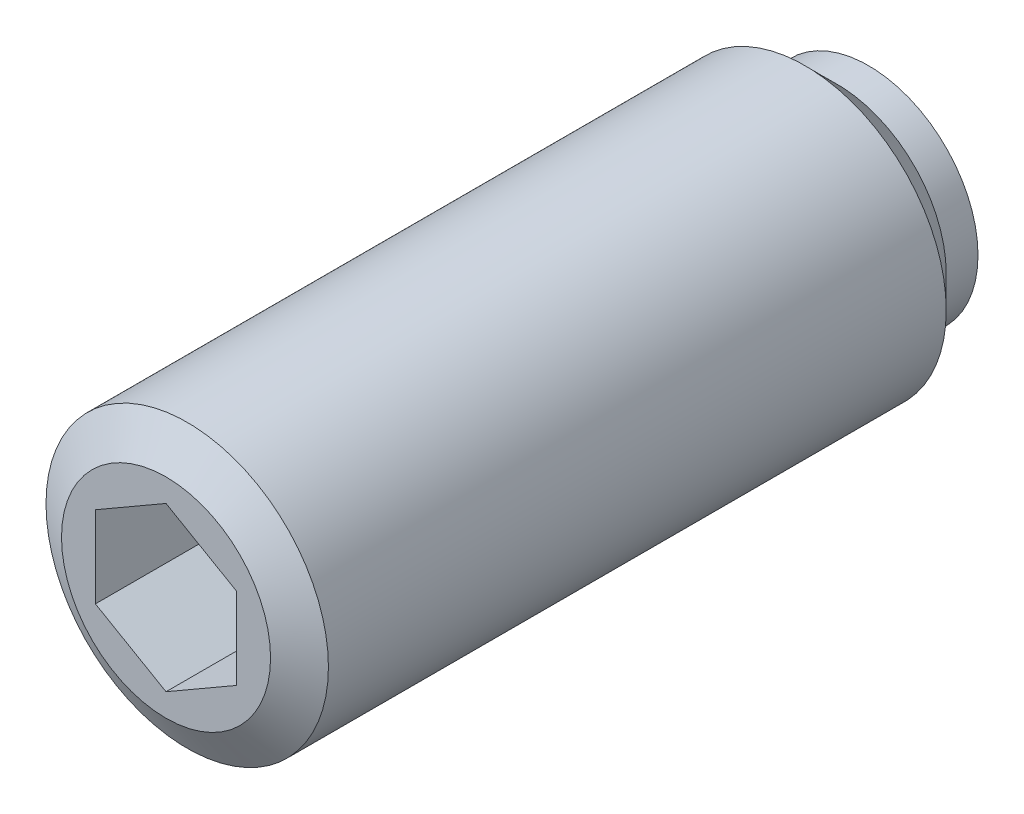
ISO-10303-21;
HEADER;
FILE_DESCRIPTION(('STEP AP214'),'2;1');
FILE_NAME('part.step','',(''),(''),'','','');
FILE_SCHEMA(('AUTOMOTIVE_DESIGN { 1 0 10303 214 1 1 1 1 }'));
ENDSEC;
DATA;
#1=APPLICATION_CONTEXT('core data for automotive mechanical design processes');
#2=APPLICATION_PROTOCOL_DEFINITION('international standard','automotive_design',2000,#1);
#3=PRODUCT_CONTEXT('',#1,'mechanical');
#4=PRODUCT('Part','Part','',(#3));
#5=PRODUCT_RELATED_PRODUCT_CATEGORY('part','',(#4));
#6=PRODUCT_DEFINITION_FORMATION('','',#4);
#7=PRODUCT_DEFINITION_CONTEXT('part definition',#1,'design');
#8=PRODUCT_DEFINITION('design','',#6,#7);
#9=PRODUCT_DEFINITION_SHAPE('','',#8);
#10=(LENGTH_UNIT() NAMED_UNIT(*) SI_UNIT(.MILLI.,.METRE.));
#11=(NAMED_UNIT(*) PLANE_ANGLE_UNIT() SI_UNIT($,.RADIAN.));
#12=(NAMED_UNIT(*) SI_UNIT($,.STERADIAN.) SOLID_ANGLE_UNIT());
#13=UNCERTAINTY_MEASURE_WITH_UNIT(LENGTH_MEASURE(1.E-05),#10,'distance_accuracy_value','');
#14=(GEOMETRIC_REPRESENTATION_CONTEXT(3) GLOBAL_UNCERTAINTY_ASSIGNED_CONTEXT((#13)) GLOBAL_UNIT_ASSIGNED_CONTEXT((#10,
#11,#12)) REPRESENTATION_CONTEXT('',''));
#15=CARTESIAN_POINT('',(0.,0.,0.));
#16=DIRECTION('',(0.,0.,1.));
#17=DIRECTION('',(1.,0.,0.));
#18=AXIS2_PLACEMENT_3D('',#15,#16,#17);
#19=CARTESIAN_POINT('',(0.,2.09621086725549,0.));
#20=DIRECTION('',(0.,0.,1.));
#21=DIRECTION('',(-1.,0.,0.));
#22=AXIS2_PLACEMENT_3D('',#19,#20,#21);
#23=PLANE('',#22);
#24=CARTESIAN_POINT('',(0.,0.,0.));
#25=DIRECTION('',(0.,0.,1.));
#26=DIRECTION('',(-1.,0.,0.));
#27=AXIS2_PLACEMENT_3D('',#24,#25,#26);
#28=CIRCLE('',#27,2.09621086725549);
#29=CARTESIAN_POINT('',(0.,2.09621086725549,0.));
#30=VERTEX_POINT('',#29);
#31=EDGE_CURVE('E9',#30,#30,#28,.T.);
#32=ORIENTED_EDGE('',*,*,#31,.F.);
#33=EDGE_LOOP('',(#32));
#34=FACE_BOUND('',#33,.T.);
#35=ADVANCED_FACE('F14',(#34),#23,.F.);
#36=CARTESIAN_POINT('',(0.,0.,1.78));
#37=DIRECTION('',(0.,0.,1.));
#38=DIRECTION('',(0.,1.,0.));
#39=AXIS2_PLACEMENT_3D('',#36,#37,#38);
#40=SPHERICAL_SURFACE('',#39,2.75);
#41=CARTESIAN_POINT('',(0.,0.,0.5));
#42=DIRECTION('',(0.,0.,1.));
#43=DIRECTION('',(-1.,0.,0.));
#44=AXIS2_PLACEMENT_3D('',#41,#42,#43);
#45=CIRCLE('',#44,2.43394741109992);
#46=CARTESIAN_POINT('',(0.,2.43394741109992,0.5));
#47=VERTEX_POINT('',#46);
#48=EDGE_CURVE('E21',#47,#47,#45,.T.);
#49=CARTESIAN_POINT('',(0.,2.43394741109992,0.5));
#50=CARTESIAN_POINT('',(0.,2.43101603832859,0.494425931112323));
#51=CARTESIAN_POINT('',(0.,2.42806551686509,0.488861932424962));
#52=CARTESIAN_POINT('',(0.,2.42212631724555,0.477754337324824));
#53=CARTESIAN_POINT('',(0.,2.41913763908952,0.472210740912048));
#54=CARTESIAN_POINT('',(0.,2.41312226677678,0.46114421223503));
#55=CARTESIAN_POINT('',(0.,2.41009557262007,0.455621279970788));
#56=CARTESIAN_POINT('',(0.,2.40400431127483,0.444596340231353));
#57=CARTESIAN_POINT('',(0.,2.40093974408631,0.439094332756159));
#58=CARTESIAN_POINT('',(0.,2.39477288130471,0.428111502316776));
#59=CARTESIAN_POINT('',(0.,2.39167058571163,0.422630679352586));
#60=CARTESIAN_POINT('',(0.,2.38542841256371,0.411690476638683));
#61=CARTESIAN_POINT('',(0.,2.38228853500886,0.40623109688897));
#62=CARTESIAN_POINT('',(0.,2.37597134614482,0.39533403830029));
#63=CARTESIAN_POINT('',(0.,2.37279403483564,0.389896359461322));
#64=CARTESIAN_POINT('',(0.,2.36640212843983,0.379042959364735));
#65=CARTESIAN_POINT('',(0.,2.3631875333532,0.373627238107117));
#66=CARTESIAN_POINT('',(0.,2.35672121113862,0.362818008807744));
#67=CARTESIAN_POINT('',(0.,2.35346948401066,0.35742450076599));
#68=CARTESIAN_POINT('',(0.,2.3469290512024,0.346659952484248));
#69=CARTESIAN_POINT('',(0.,2.3436403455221,0.341288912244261));
#70=CARTESIAN_POINT('',(0.,2.3370261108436,0.330569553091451));
#71=CARTESIAN_POINT('',(0.,2.33370058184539,0.325221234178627));
#72=CARTESIAN_POINT('',(0.,2.32701285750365,0.314547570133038));
#73=CARTESIAN_POINT('',(0.,2.32365066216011,0.309222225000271));
#74=CARTESIAN_POINT('',(0.,2.31688976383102,0.298594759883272));
#75=CARTESIAN_POINT('',(0.,2.31349106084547,0.293292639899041));
#76=CARTESIAN_POINT('',(0.,2.30665730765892,0.28271187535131));
#77=CARTESIAN_POINT('',(0.,2.30322225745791,0.277433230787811));
#78=CARTESIAN_POINT('',(0.,2.29631597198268,0.266899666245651));
#79=CARTESIAN_POINT('',(0.,2.29284473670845,0.261644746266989));
#80=CARTESIAN_POINT('',(0.,2.28586624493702,0.251158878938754));
#81=CARTESIAN_POINT('',(0.,2.28235898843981,0.24592793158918));
#82=CARTESIAN_POINT('',(0.,2.27530861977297,0.235490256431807));
#83=CARTESIAN_POINT('',(0.,2.27176550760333,0.230283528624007));
#84=CARTESIAN_POINT('',(0.,2.26464359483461,0.219894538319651));
#85=CARTESIAN_POINT('',(0.,2.26106479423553,0.214712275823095));
#86=CARTESIAN_POINT('',(0.,2.25387167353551,0.204372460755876));
#87=CARTESIAN_POINT('',(0.,2.25025735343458,0.199214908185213));
#88=CARTESIAN_POINT('',(0.,2.24299336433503,0.188924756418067));
#89=CARTESIAN_POINT('',(0.,2.23934369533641,0.183792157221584));
#90=CARTESIAN_POINT('',(0.,2.23200918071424,0.173552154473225));
#91=CARTESIAN_POINT('',(0.,2.22832433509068,0.168444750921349));
#92=CARTESIAN_POINT('',(0.,2.22091964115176,0.158255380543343));
#93=CARTESIAN_POINT('',(0.,2.2171997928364,0.153173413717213));
#94=CARTESIAN_POINT('',(0.,2.20972526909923,0.143035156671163));
#95=CARTESIAN_POINT('',(0.,2.20597059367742,0.137978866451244));
#96=CARTESIAN_POINT('',(0.,2.19842659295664,0.127892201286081));
#97=CARTESIAN_POINT('',(0.,2.19463726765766,0.122861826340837));
#98=CARTESIAN_POINT('',(0.,2.18702414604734,0.112827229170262));
#99=CARTESIAN_POINT('',(0.,2.183200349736,0.10782300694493));
#100=CARTESIAN_POINT('',(0.,2.17551846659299,0.0978409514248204));
#101=CARTESIAN_POINT('',(0.,2.17166037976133,0.0928631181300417));
#102=CARTESIAN_POINT('',(0.,2.16391009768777,0.0829340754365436));
#103=CARTESIAN_POINT('',(0.,2.16001790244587,0.0779828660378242));
#104=CARTESIAN_POINT('',(0.,2.15219958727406,0.0681073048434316));
#105=CARTESIAN_POINT('',(0.,2.14827346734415,0.0631829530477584));
#106=CARTESIAN_POINT('',(0.,2.14038748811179,0.0533613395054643));
#107=CARTESIAN_POINT('',(0.,2.13642762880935,0.0484640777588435));
#108=CARTESIAN_POINT('',(0.,2.12847435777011,0.0386968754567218));
#109=CARTESIAN_POINT('',(0.,2.12448094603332,0.0338269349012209));
#110=CARTESIAN_POINT('',(0.,2.11646075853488,0.024114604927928));
#111=CARTESIAN_POINT('',(0.,2.11243398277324,0.019272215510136));
#112=CARTESIAN_POINT('',(0.,2.10434725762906,0.0096152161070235));
#113=CARTESIAN_POINT('',(0.,2.10028730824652,0.00480060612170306));
#114=CARTESIAN_POINT('',(0.,2.09621086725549,0.));
#115=B_SPLINE_CURVE_WITH_KNOTS('',3,(#49,#50,#51,#52,#53,#54,#55,#56,#57,#58,#59,#60,#61,#62,
#63,#64,#65,#66,#67,#68,#69,#70,#71,#72,#73,#74,#75,#76,#77,#78,#79,#80,#81,#82,#83,#84,#85,#86,
#87,#88,#89,#90,#91,#92,#93,#94,#95,#96,#97,#98,#99,#100,#101,#102,#103,#104,#105,#106,#107,
#108,#109,#110,#111,#112,#113,#114),.UNSPECIFIED.,.F.,.F.,(4,2,2,2,2,2,2,2,2,2,2,2,2,2,2,2,2,2,
2,2,2,2,2,2,2,2,2,2,2,2,2,2,4),(0.,0.0188935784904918,0.0377871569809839,0.0566807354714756,
0.0755743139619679,0.0944678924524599,0.113361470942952,0.132255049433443,0.151148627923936,
0.170042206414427,0.188935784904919,0.207829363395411,0.226722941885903,0.245616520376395,
0.264510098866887,0.283403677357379,0.302297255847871,0.321190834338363,0.340084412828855,
0.358977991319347,0.377871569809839,0.396765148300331,0.415658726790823,0.434552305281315,
0.453445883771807,0.472339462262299,0.491233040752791,0.510126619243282,0.529020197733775,
0.547913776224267,0.566807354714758,0.58570093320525,0.604594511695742),.UNSPECIFIED.);
#116=EDGE_CURVE('BSEAM141',#47,#30,#115,.T.);
#117=ORIENTED_EDGE('',*,*,#48,.F.);
#118=ORIENTED_EDGE('',*,*,#31,.T.);
#119=ORIENTED_EDGE('',*,*,#116,.T.);
#120=ORIENTED_EDGE('',*,*,#116,.F.);
#121=EDGE_LOOP('',(#117,#119,#118,#120));
#122=FACE_BOUND('',#121,.T.);
#123=ADVANCED_FACE('F141',(#122),#40,.T.);
#124=CARTESIAN_POINT('',(0.,3.1,0.5));
#125=DIRECTION('',(0.,0.,1.));
#126=DIRECTION('',(-1.,0.,0.));
#127=AXIS2_PLACEMENT_3D('',#124,#125,#126);
#128=PLANE('',#127);
#129=CARTESIAN_POINT('',(0.,0.,0.5));
#130=DIRECTION('',(0.,0.,1.));
#131=DIRECTION('',(-1.,0.,0.));
#132=AXIS2_PLACEMENT_3D('',#129,#130,#131);
#133=CIRCLE('',#132,3.1);
#134=CARTESIAN_POINT('',(-3.1,0.,0.5));
#135=VERTEX_POINT('',#134);
#136=EDGE_CURVE('E134',#135,#135,#133,.T.);
#137=ORIENTED_EDGE('',*,*,#136,.F.);
#138=EDGE_LOOP('',(#137));
#139=FACE_BOUND('',#138,.T.);
#140=ORIENTED_EDGE('',*,*,#48,.T.);
#141=EDGE_LOOP('',(#140));
#142=FACE_BOUND('',#141,.T.);
#143=ADVANCED_FACE('F139',(#139,#142),#128,.F.);
#144=CARTESIAN_POINT('',(0.,0.,21.7950749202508));
#145=DIRECTION('',(0.,0.,1.));
#146=DIRECTION('',(-1.,0.,0.));
#147=AXIS2_PLACEMENT_3D('',#144,#145,#146);
#148=CYLINDRICAL_SURFACE('',#147,3.1);
#149=CARTESIAN_POINT('',(0.,0.,1.4));
#150=DIRECTION('',(0.,0.,1.));
#151=DIRECTION('',(-1.,0.,0.));
#152=AXIS2_PLACEMENT_3D('',#149,#150,#151);
#153=CIRCLE('',#152,3.1);
#154=CARTESIAN_POINT('',(-3.1,0.,1.4));
#155=VERTEX_POINT('',#154);
#156=EDGE_CURVE('E131',#155,#155,#153,.T.);
#157=ORIENTED_EDGE('',*,*,#156,.F.);
#158=EDGE_LOOP('',(#157));
#159=FACE_BOUND('',#158,.T.);
#160=ORIENTED_EDGE('',*,*,#136,.T.);
#161=EDGE_LOOP('',(#160));
#162=FACE_BOUND('',#161,.T.);
#163=ADVANCED_FACE('F164',(#159,#162),#148,.T.);
#164=CARTESIAN_POINT('',(0.,0.,1.4));
#165=DIRECTION('',(0.,0.,1.));
#166=DIRECTION('',(-1.,0.,0.));
#167=AXIS2_PLACEMENT_3D('',#164,#165,#166);
#168=CONICAL_SURFACE('',#167,3.1,0.785398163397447);
#169=CARTESIAN_POINT('',(0.,0.,2.3));
#170=DIRECTION('',(0.,0.,1.));
#171=DIRECTION('',(-1.,0.,0.));
#172=AXIS2_PLACEMENT_3D('',#169,#170,#171);
#173=CIRCLE('',#172,4.);
#174=CARTESIAN_POINT('',(-4.,0.,2.3));
#175=VERTEX_POINT('',#174);
#176=EDGE_CURVE('E128',#175,#175,#173,.T.);
#177=ORIENTED_EDGE('',*,*,#176,.F.);
#178=EDGE_LOOP('',(#177));
#179=FACE_BOUND('',#178,.T.);
#180=ORIENTED_EDGE('',*,*,#156,.T.);
#181=EDGE_LOOP('',(#180));
#182=FACE_BOUND('',#181,.T.);
#183=ADVANCED_FACE('F173',(#179,#182),#168,.T.);
#184=CARTESIAN_POINT('',(0.,0.,21.7950749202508));
#185=DIRECTION('',(0.,0.,1.));
#186=DIRECTION('',(-1.,0.,0.));
#187=AXIS2_PLACEMENT_3D('',#184,#185,#186);
#188=CYLINDRICAL_SURFACE('',#187,4.);
#189=CARTESIAN_POINT('',(0.,0.,19.8));
#190=DIRECTION('',(0.,0.,1.));
#191=DIRECTION('',(-1.,0.,0.));
#192=AXIS2_PLACEMENT_3D('',#189,#190,#191);
#193=CIRCLE('',#192,4.);
#194=CARTESIAN_POINT('',(-4.,0.,19.8));
#195=VERTEX_POINT('',#194);
#196=EDGE_CURVE('E125',#195,#195,#193,.T.);
#197=ORIENTED_EDGE('',*,*,#196,.F.);
#198=EDGE_LOOP('',(#197));
#199=FACE_BOUND('',#198,.T.);
#200=ORIENTED_EDGE('',*,*,#176,.T.);
#201=EDGE_LOOP('',(#200));
#202=FACE_BOUND('',#201,.T.);
#203=ADVANCED_FACE('F182',(#199,#202),#188,.T.);
#204=CARTESIAN_POINT('',(0.,0.,19.8));
#205=DIRECTION('',(0.,0.,-1.));
#206=DIRECTION('',(1.,0.,0.));
#207=AXIS2_PLACEMENT_3D('',#204,#205,#206);
#208=CONICAL_SURFACE('',#207,4.,1.04719755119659);
#209=CARTESIAN_POINT('',(0.,0.,20.4));
#210=DIRECTION('',(0.,0.,1.));
#211=DIRECTION('',(-1.,0.,0.));
#212=AXIS2_PLACEMENT_3D('',#209,#210,#211);
#213=CIRCLE('',#212,2.9607695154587);
#214=CARTESIAN_POINT('',(-2.9607695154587,0.,20.4));
#215=VERTEX_POINT('',#214);
#216=EDGE_CURVE('E116',#215,#215,#213,.T.);
#217=ORIENTED_EDGE('',*,*,#216,.F.);
#218=EDGE_LOOP('',(#217));
#219=FACE_BOUND('',#218,.T.);
#220=ORIENTED_EDGE('',*,*,#196,.T.);
#221=EDGE_LOOP('',(#220));
#222=FACE_BOUND('',#221,.T.);
#223=ADVANCED_FACE('F191',(#219,#222),#208,.T.);
#224=CARTESIAN_POINT('',(0.,0.,20.4));
#225=DIRECTION('',(0.,0.,-1.));
#226=DIRECTION('',(1.,0.,0.));
#227=AXIS2_PLACEMENT_3D('',#224,#225,#226);
#228=PLANE('',#227);
#229=DIRECTION('',(-0.866025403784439,-0.5,0.));
#230=VECTOR('',#229,1.);
#231=CARTESIAN_POINT('',(0.,2.30940107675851,20.4));
#232=LINE('',#231,#230);
#233=CARTESIAN_POINT('',(0.,2.30940107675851,20.4));
#234=VERTEX_POINT('',#233);
#235=CARTESIAN_POINT('',(-2.,1.15470053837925,20.4));
#236=VERTEX_POINT('',#235);
#237=EDGE_CURVE('E82',#234,#236,#232,.T.);
#238=ORIENTED_EDGE('',*,*,#237,.F.);
#239=DIRECTION('',(-0.866025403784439,0.5,0.));
#240=VECTOR('',#239,1.);
#241=CARTESIAN_POINT('',(2.,1.15470053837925,20.4));
#242=LINE('',#241,#240);
#243=CARTESIAN_POINT('',(2.,1.15470053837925,20.4));
#244=VERTEX_POINT('',#243);
#245=EDGE_CURVE('E28',#244,#234,#242,.T.);
#246=ORIENTED_EDGE('',*,*,#245,.F.);
#247=DIRECTION('',(0.,1.,0.));
#248=VECTOR('',#247,1.);
#249=CARTESIAN_POINT('',(2.,-1.15470053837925,20.4));
#250=LINE('',#249,#248);
#251=CARTESIAN_POINT('',(2.,-1.15470053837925,20.4));
#252=VERTEX_POINT('',#251);
#253=EDGE_CURVE('E98',#252,#244,#250,.T.);
#254=ORIENTED_EDGE('',*,*,#253,.F.);
#255=DIRECTION('',(0.866025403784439,0.5,0.));
#256=VECTOR('',#255,1.);
#257=CARTESIAN_POINT('',(0.,-2.30940107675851,20.4));
#258=LINE('',#257,#256);
#259=CARTESIAN_POINT('',(0.,-2.30940107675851,20.4));
#260=VERTEX_POINT('',#259);
#261=EDGE_CURVE('E92',#260,#252,#258,.T.);
#262=ORIENTED_EDGE('',*,*,#261,.F.);
#263=DIRECTION('',(0.866025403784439,-0.5,0.));
#264=VECTOR('',#263,1.);
#265=CARTESIAN_POINT('',(-2.,-1.15470053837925,20.4));
#266=LINE('',#265,#264);
#267=CARTESIAN_POINT('',(-2.,-1.15470053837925,20.4));
#268=VERTEX_POINT('',#267);
#269=EDGE_CURVE('E90',#268,#260,#266,.T.);
#270=ORIENTED_EDGE('',*,*,#269,.F.);
#271=DIRECTION('',(0.,-1.,0.));
#272=VECTOR('',#271,1.);
#273=CARTESIAN_POINT('',(-2.,1.15470053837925,20.4));
#274=LINE('',#273,#272);
#275=EDGE_CURVE('E71',#236,#268,#274,.T.);
#276=ORIENTED_EDGE('',*,*,#275,.F.);
#277=EDGE_LOOP('',(#238,#246,#254,#262,#270,#276));
#278=FACE_BOUND('',#277,.T.);
#279=ORIENTED_EDGE('',*,*,#216,.T.);
#280=EDGE_LOOP('',(#279));
#281=FACE_BOUND('',#280,.T.);
#282=ADVANCED_FACE('F86',(#278,#281),#228,.F.);
#283=CARTESIAN_POINT('',(2.,1.15470053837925,16.4));
#284=DIRECTION('',(0.5,0.866025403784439,0.));
#285=DIRECTION('',(0.866025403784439,-0.5,0.));
#286=AXIS2_PLACEMENT_3D('',#283,#284,#285);
#287=PLANE('',#286);
#288=ORIENTED_EDGE('',*,*,#245,.T.);
#289=DIRECTION('',(0.,0.,1.));
#290=VECTOR('',#289,1.);
#291=CARTESIAN_POINT('',(0.,2.30940107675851,16.4));
#292=LINE('',#291,#290);
#293=CARTESIAN_POINT('',(0.,2.30940107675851,16.4));
#294=VERTEX_POINT('',#293);
#295=EDGE_CURVE('E79',#294,#234,#292,.T.);
#296=ORIENTED_EDGE('',*,*,#295,.F.);
#297=DIRECTION('',(-0.866025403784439,0.5,0.));
#298=VECTOR('',#297,1.);
#299=CARTESIAN_POINT('',(2.,1.15470053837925,16.4));
#300=LINE('',#299,#298);
#301=CARTESIAN_POINT('',(2.,1.15470053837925,16.4));
#302=VERTEX_POINT('',#301);
#303=EDGE_CURVE('E100',#302,#294,#300,.T.);
#304=ORIENTED_EDGE('',*,*,#303,.F.);
#305=DIRECTION('',(0.,0.,1.));
#306=VECTOR('',#305,1.);
#307=CARTESIAN_POINT('',(2.,1.15470053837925,16.4));
#308=LINE('',#307,#306);
#309=EDGE_CURVE('E35',#302,#244,#308,.T.);
#310=ORIENTED_EDGE('',*,*,#309,.T.);
#311=EDGE_LOOP('',(#288,#296,#304,#310));
#312=FACE_BOUND('',#311,.T.);
#313=ADVANCED_FACE('F208',(#312),#287,.F.);
#314=CARTESIAN_POINT('',(2.,-1.15470053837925,16.4));
#315=DIRECTION('',(1.,0.,0.));
#316=DIRECTION('',(0.,0.,1.));
#317=AXIS2_PLACEMENT_3D('',#314,#315,#316);
#318=PLANE('',#317);
#319=ORIENTED_EDGE('',*,*,#253,.T.);
#320=ORIENTED_EDGE('',*,*,#309,.F.);
#321=DIRECTION('',(0.,1.,0.));
#322=VECTOR('',#321,1.);
#323=CARTESIAN_POINT('',(2.,-1.15470053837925,16.4));
#324=LINE('',#323,#322);
#325=CARTESIAN_POINT('',(2.,-1.15470053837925,16.4));
#326=VERTEX_POINT('',#325);
#327=EDGE_CURVE('E112',#326,#302,#324,.T.);
#328=ORIENTED_EDGE('',*,*,#327,.F.);
#329=DIRECTION('',(0.,0.,1.));
#330=VECTOR('',#329,1.);
#331=CARTESIAN_POINT('',(2.,-1.15470053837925,16.4));
#332=LINE('',#331,#330);
#333=EDGE_CURVE('E117',#326,#252,#332,.T.);
#334=ORIENTED_EDGE('',*,*,#333,.T.);
#335=EDGE_LOOP('',(#319,#320,#328,#334));
#336=FACE_BOUND('',#335,.T.);
#337=ADVANCED_FACE('F216',(#336),#318,.F.);
#338=CARTESIAN_POINT('',(0.,-2.30940107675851,16.4));
#339=DIRECTION('',(0.5,-0.866025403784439,0.));
#340=DIRECTION('',(-0.866025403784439,-0.5,0.));
#341=AXIS2_PLACEMENT_3D('',#338,#339,#340);
#342=PLANE('',#341);
#343=ORIENTED_EDGE('',*,*,#261,.T.);
#344=ORIENTED_EDGE('',*,*,#333,.F.);
#345=DIRECTION('',(0.866025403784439,0.5,0.));
#346=VECTOR('',#345,1.);
#347=CARTESIAN_POINT('',(0.,-2.30940107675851,16.4));
#348=LINE('',#347,#346);
#349=CARTESIAN_POINT('',(0.,-2.30940107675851,16.4));
#350=VERTEX_POINT('',#349);
#351=EDGE_CURVE('E109',#350,#326,#348,.T.);
#352=ORIENTED_EDGE('',*,*,#351,.F.);
#353=DIRECTION('',(0.,0.,1.));
#354=VECTOR('',#353,1.);
#355=CARTESIAN_POINT('',(0.,-2.30940107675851,16.4));
#356=LINE('',#355,#354);
#357=EDGE_CURVE('E119',#350,#260,#356,.T.);
#358=ORIENTED_EDGE('',*,*,#357,.T.);
#359=EDGE_LOOP('',(#343,#344,#352,#358));
#360=FACE_BOUND('',#359,.T.);
#361=ADVANCED_FACE('F224',(#360),#342,.F.);
#362=CARTESIAN_POINT('',(-2.,-1.15470053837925,16.4));
#363=DIRECTION('',(-0.5,-0.866025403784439,0.));
#364=DIRECTION('',(-0.866025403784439,0.5,0.));
#365=AXIS2_PLACEMENT_3D('',#362,#363,#364);
#366=PLANE('',#365);
#367=ORIENTED_EDGE('',*,*,#269,.T.);
#368=ORIENTED_EDGE('',*,*,#357,.F.);
#369=DIRECTION('',(0.866025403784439,-0.5,0.));
#370=VECTOR('',#369,1.);
#371=CARTESIAN_POINT('',(-2.,-1.15470053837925,16.4));
#372=LINE('',#371,#370);
#373=CARTESIAN_POINT('',(-2.,-1.15470053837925,16.4));
#374=VERTEX_POINT('',#373);
#375=EDGE_CURVE('E106',#374,#350,#372,.T.);
#376=ORIENTED_EDGE('',*,*,#375,.F.);
#377=DIRECTION('',(0.,0.,1.));
#378=VECTOR('',#377,1.);
#379=CARTESIAN_POINT('',(-2.,-1.15470053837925,16.4));
#380=LINE('',#379,#378);
#381=EDGE_CURVE('E78',#374,#268,#380,.T.);
#382=ORIENTED_EDGE('',*,*,#381,.T.);
#383=EDGE_LOOP('',(#367,#368,#376,#382));
#384=FACE_BOUND('',#383,.T.);
#385=ADVANCED_FACE('F232',(#384),#366,.F.);
#386=CARTESIAN_POINT('',(-2.,1.15470053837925,16.4));
#387=DIRECTION('',(-1.,0.,0.));
#388=DIRECTION('',(0.,1.,0.));
#389=AXIS2_PLACEMENT_3D('',#386,#387,#388);
#390=PLANE('',#389);
#391=ORIENTED_EDGE('',*,*,#275,.T.);
#392=ORIENTED_EDGE('',*,*,#381,.F.);
#393=DIRECTION('',(0.,-1.,0.));
#394=VECTOR('',#393,1.);
#395=CARTESIAN_POINT('',(-2.,1.15470053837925,16.4));
#396=LINE('',#395,#394);
#397=CARTESIAN_POINT('',(-2.,1.15470053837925,16.4));
#398=VERTEX_POINT('',#397);
#399=EDGE_CURVE('E74',#398,#374,#396,.T.);
#400=ORIENTED_EDGE('',*,*,#399,.F.);
#401=DIRECTION('',(0.,0.,1.));
#402=VECTOR('',#401,1.);
#403=CARTESIAN_POINT('',(-2.,1.15470053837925,16.4));
#404=LINE('',#403,#402);
#405=EDGE_CURVE('E67',#398,#236,#404,.T.);
#406=ORIENTED_EDGE('',*,*,#405,.T.);
#407=EDGE_LOOP('',(#391,#392,#400,#406));
#408=FACE_BOUND('',#407,.T.);
#409=ADVANCED_FACE('F69',(#408),#390,.F.);
#410=CARTESIAN_POINT('',(0.,2.30940107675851,16.4));
#411=DIRECTION('',(-0.5,0.866025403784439,0.));
#412=DIRECTION('',(0.866025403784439,0.5,0.));
#413=AXIS2_PLACEMENT_3D('',#410,#411,#412);
#414=PLANE('',#413);
#415=ORIENTED_EDGE('',*,*,#237,.T.);
#416=ORIENTED_EDGE('',*,*,#405,.F.);
#417=DIRECTION('',(-0.866025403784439,-0.5,0.));
#418=VECTOR('',#417,1.);
#419=CARTESIAN_POINT('',(0.,2.30940107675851,16.4));
#420=LINE('',#419,#418);
#421=EDGE_CURVE('E103',#294,#398,#420,.T.);
#422=ORIENTED_EDGE('',*,*,#421,.F.);
#423=ORIENTED_EDGE('',*,*,#295,.T.);
#424=EDGE_LOOP('',(#415,#416,#422,#423));
#425=FACE_BOUND('',#424,.T.);
#426=ADVANCED_FACE('F83',(#425),#414,.F.);
#427=CARTESIAN_POINT('',(2.,1.15470053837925,16.4));
#428=DIRECTION('',(0.,0.,-1.));
#429=DIRECTION('',(1.,0.,0.));
#430=AXIS2_PLACEMENT_3D('',#427,#428,#429);
#431=PLANE('',#430);
#432=ORIENTED_EDGE('',*,*,#303,.T.);
#433=ORIENTED_EDGE('',*,*,#421,.T.);
#434=ORIENTED_EDGE('',*,*,#399,.T.);
#435=ORIENTED_EDGE('',*,*,#375,.T.);
#436=ORIENTED_EDGE('',*,*,#351,.T.);
#437=ORIENTED_EDGE('',*,*,#327,.T.);
#438=EDGE_LOOP('',(#432,#433,#434,#435,#436,#437));
#439=FACE_BOUND('',#438,.T.);
#440=ADVANCED_FACE('F256',(#439),#431,.F.);
#441=CLOSED_SHELL('',(#35,#123,#143,#163,#183,#203,#223,#282,#313,#337,#361,#385,#409,#426,#440));
#442=MANIFOLD_SOLID_BREP('B1',#441);
#443=ADVANCED_BREP_SHAPE_REPRESENTATION('',(#18,#442),#14);
#444=SHAPE_DEFINITION_REPRESENTATION(#9,#443);
ENDSEC;
END-ISO-10303-21;
